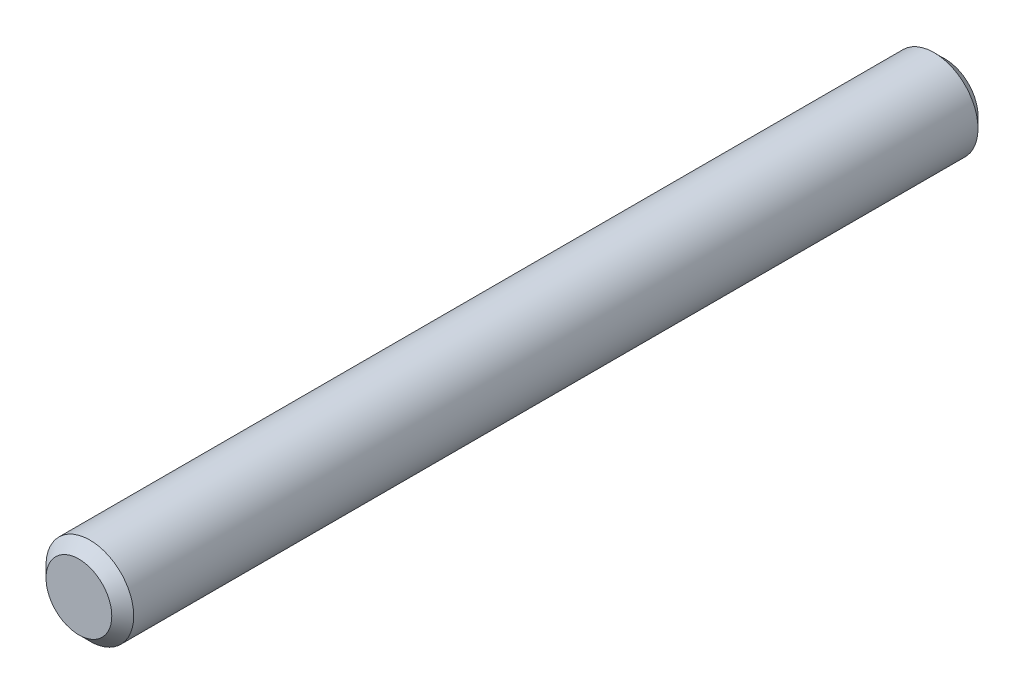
from build123d import *

# Parameters (mm, degrees)
BASE_EXTRUSION_DEPTH      = 17.6
BASE_EXTRUSION_DEPTH_BACK = 2.15
ESQUISSE1_R               = 1
CHANFREIN2_SIZE           = 0.25


with BuildPart() as part:
    # Esquisse1 → Base-Extrusion (new, two sides: drawn at the far end of the back side and taken through both)
    with BuildSketch(Plane.XY.offset(-BASE_EXTRUSION_DEPTH_BACK)):
        with Locations((16.875, 12.728357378)):
            Circle(ESQUISSE1_R)
    extrude(amount=BASE_EXTRUSION_DEPTH + BASE_EXTRUSION_DEPTH_BACK)

    # Chanfrein2
    chanfrein2_edges = [part.edges().sort_by_distance(p)[0] for p in [
        (15.875, 12.728357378, 17.6),
        (15.875, 12.728357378, -2.15),
    ]]
    chamfer(chanfrein2_edges, length=CHANFREIN2_SIZE)


solid = part.part
